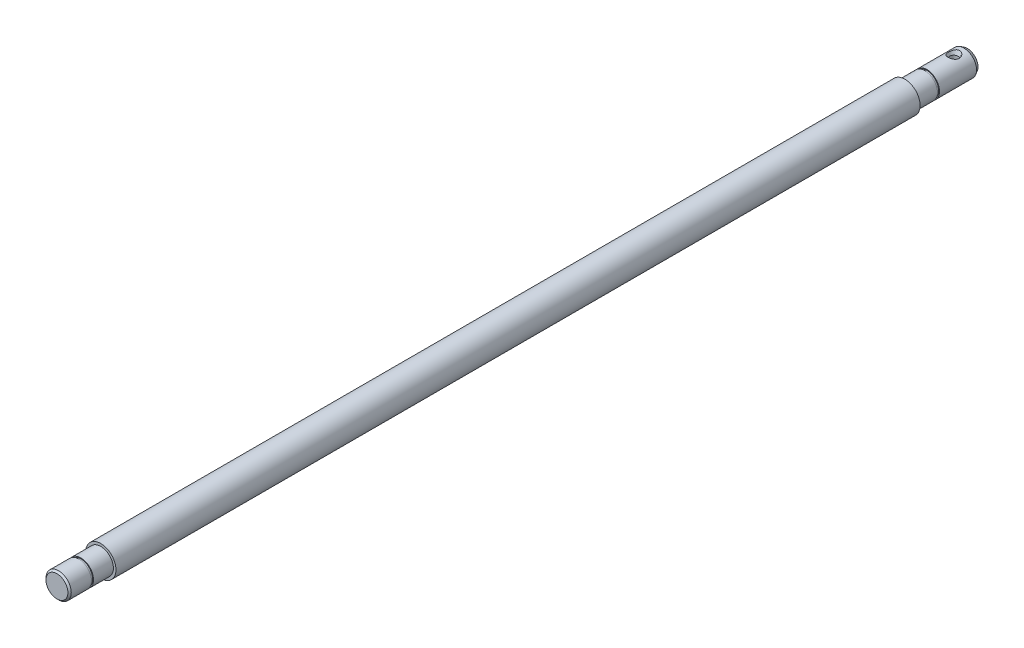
from build123d import *

# Parameters (mm, degrees)
ESQUISSE1_R      = 7.5
EXTRUSION1_DEPTH = 540
CHANFREIN1_SIZE  = 2
CHANFREIN1_SIZE2 = 1.154700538
ESQUISSE4_W      = 0.5
ESQUISSE4_H      = 1.2
ESQUISSE5_R      = 9
EXTRUSION2_DEPTH = 477
ESQUISSE6_W      = 0.5
ESQUISSE6_H      = 1.2
CHANFREIN2_SIZE  = 1


with BuildPart() as part:
    # Esquisse1 → Extrusion1 (new body)
    with BuildSketch(Plane.XY):
        Circle(ESQUISSE1_R)
    extrude(amount=EXTRUSION1_DEPTH)

    # Chanfrein1
    chanfrein1_edges = [part.edges().sort_by_distance(p)[0] for p in [
        (-7.5, 0, 0),
    ]]
    chanfrein1_side = [part.faces().sort_by_distance(p)[0] for p in [
        (-7.5, 0, 270),
    ]]
    chamfer(chanfrein1_edges, length=CHANFREIN1_SIZE, length2=CHANFREIN1_SIZE2, reference=chanfrein1_side[0])

    # Esquisse2 → Trou taraud_ M61 (revolve, cut)
    with BuildSketch(Plane(origin=(0, 7.5, 8), x_dir=(0, 0, 1), z_dir=(1, 0, 0))):
        Polygon((0, 0), (0, 15), (3.5, 15), (2.5, 12.585786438), (2.5, 2.414213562), (3.5, 0), align=None)
    revolve(axis=Axis((0, 13.85, 8), (0, -1, 0)), mode=Mode.SUBTRACT)

    # Esquisse4 → Enl_vement de mati_re-R_volution1 (revolve, cut)
    with BuildSketch(Plane(origin=(0, 0, 0), x_dir=(1, 0, 0), z_dir=(0, 1, 0)), mode=Mode.PRIVATE) as enl_vement_de_mati_re_r_volution1_sk:
        with Locations((7.25, -24.6)):
            Rectangle(ESQUISSE4_W, ESQUISSE4_H)
    revolve(enl_vement_de_mati_re_r_volution1_sk.sketch.rotate(Axis((0, 0, 0), (0, 0, 1)), 180), axis=Axis((0, 0, 0), (0, 0, 1)), mode=Mode.SUBTRACT)

    # Esquisse5 → Extrusion2 (add)
    with BuildSketch(Plane.XY.offset(514)):
        Circle(ESQUISSE5_R)
    extrude(amount=-EXTRUSION2_DEPTH)

    # Esquisse6 → Enl_vement de mati_re-R_volution2 (revolve, cut)
    with BuildSketch(Plane(origin=(0, 0, 0), x_dir=(1, 0, 0), z_dir=(0, 1, 0))):
        with Locations((7.25, -526.4)):
            Rectangle(ESQUISSE6_W, ESQUISSE6_H)
    revolve(axis=Axis((0, 0, 539.855538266), (0, 0, -1)), mode=Mode.SUBTRACT)

    # Chanfrein2
    chanfrein2_edges = [part.edges().sort_by_distance(p)[0] for p in [
        (-7.5, 0, 540),
    ]]
    chamfer(chanfrein2_edges, length=CHANFREIN2_SIZE)


solid = part.part
